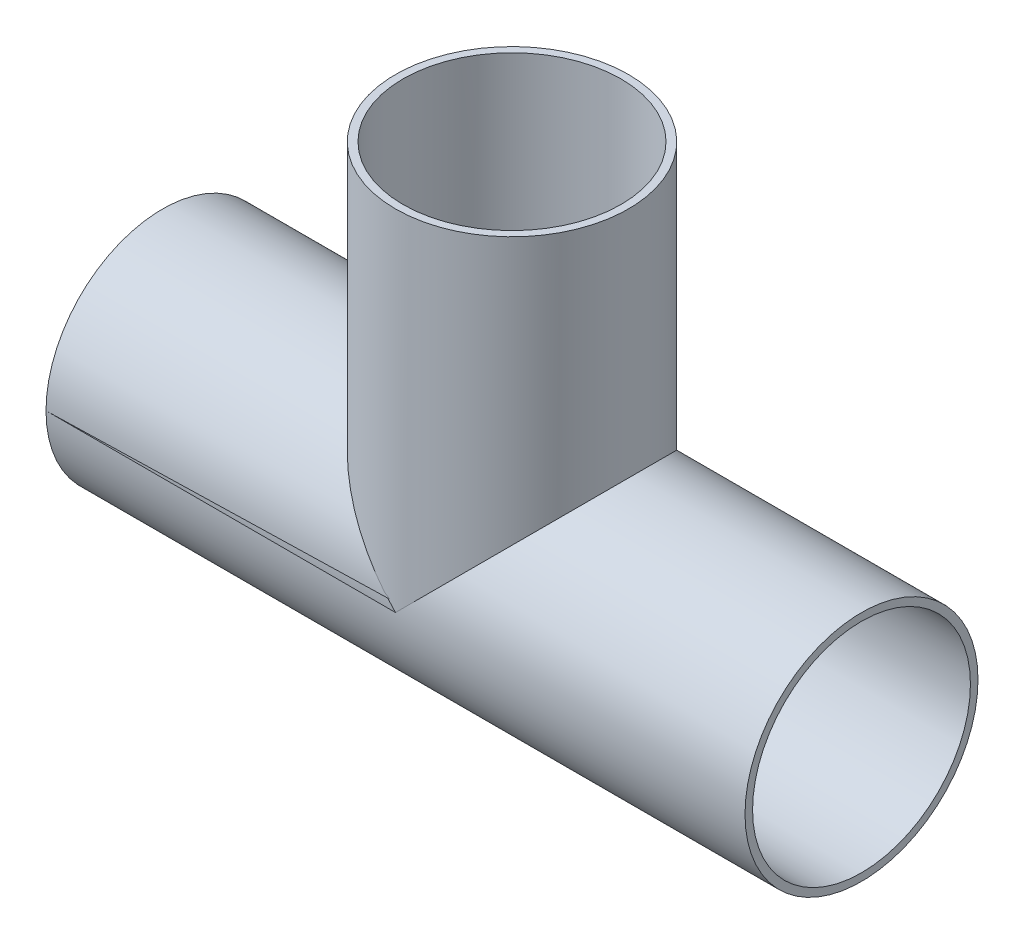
ISO-10303-21;
HEADER;
FILE_DESCRIPTION(('STEP AP214'),'2;1');
FILE_NAME('part.step','',(''),(''),'','','');
FILE_SCHEMA(('AUTOMOTIVE_DESIGN { 1 0 10303 214 1 1 1 1 }'));
ENDSEC;
DATA;
#1=APPLICATION_CONTEXT('core data for automotive mechanical design processes');
#2=APPLICATION_PROTOCOL_DEFINITION('international standard','automotive_design',2000,#1);
#3=PRODUCT_CONTEXT('',#1,'mechanical');
#4=PRODUCT('Part','Part','',(#3));
#5=PRODUCT_RELATED_PRODUCT_CATEGORY('part','',(#4));
#6=PRODUCT_DEFINITION_FORMATION('','',#4);
#7=PRODUCT_DEFINITION_CONTEXT('part definition',#1,'design');
#8=PRODUCT_DEFINITION('design','',#6,#7);
#9=PRODUCT_DEFINITION_SHAPE('','',#8);
#10=(LENGTH_UNIT() NAMED_UNIT(*) SI_UNIT(.MILLI.,.METRE.));
#11=(NAMED_UNIT(*) PLANE_ANGLE_UNIT() SI_UNIT($,.RADIAN.));
#12=(NAMED_UNIT(*) SI_UNIT($,.STERADIAN.) SOLID_ANGLE_UNIT());
#13=UNCERTAINTY_MEASURE_WITH_UNIT(LENGTH_MEASURE(1.E-05),#10,'distance_accuracy_value','');
#14=(GEOMETRIC_REPRESENTATION_CONTEXT(3) GLOBAL_UNCERTAINTY_ASSIGNED_CONTEXT((#13)) GLOBAL_UNIT_ASSIGNED_CONTEXT((#10,
#11,#12)) REPRESENTATION_CONTEXT('',''));
#15=CARTESIAN_POINT('',(0.,0.,0.));
#16=DIRECTION('',(0.,0.,1.));
#17=DIRECTION('',(1.,0.,0.));
#18=AXIS2_PLACEMENT_3D('',#15,#16,#17);
#19=CARTESIAN_POINT('',(0.,76.2,0.));
#20=DIRECTION('',(0.,-1.,0.));
#21=DIRECTION('',(0.,0.,-1.));
#22=AXIS2_PLACEMENT_3D('',#19,#20,#21);
#23=CYLINDRICAL_SURFACE('',#22,25.4);
#24=CARTESIAN_POINT('',(0.,76.2,0.));
#25=DIRECTION('',(0.,1.,0.));
#26=DIRECTION('',(0.,0.,1.));
#27=AXIS2_PLACEMENT_3D('',#24,#25,#26);
#28=CIRCLE('',#27,25.4);
#29=CARTESIAN_POINT('',(0.,76.2,25.4));
#30=VERTEX_POINT('',#29);
#31=EDGE_CURVE('E11',#30,#30,#28,.T.);
#32=ORIENTED_EDGE('',*,*,#31,.F.);
#33=EDGE_LOOP('',(#32));
#34=FACE_BOUND('',#33,.T.);
#35=CARTESIAN_POINT('',(0.,0.,0.));
#36=DIRECTION('',(-0.707106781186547,-0.707106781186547,0.));
#37=DIRECTION('',(0.707106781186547,-0.707106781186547,0.));
#38=AXIS2_PLACEMENT_3D('',#35,#36,#37);
#39=ELLIPSE('',#38,35.9210244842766,25.4);
#40=CARTESIAN_POINT('',(0.,0.,25.4));
#41=VERTEX_POINT('',#40);
#42=CARTESIAN_POINT('',(0.,0.,-25.4));
#43=VERTEX_POINT('',#42);
#44=EDGE_CURVE('E40',#41,#43,#39,.T.);
#45=ORIENTED_EDGE('',*,*,#44,.F.);
#46=CARTESIAN_POINT('',(0.,0.,0.));
#47=DIRECTION('',(0.707106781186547,-0.707106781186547,0.));
#48=DIRECTION('',(-0.707106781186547,-0.707106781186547,0.));
#49=AXIS2_PLACEMENT_3D('',#46,#47,#48);
#50=ELLIPSE('',#49,35.9210244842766,25.4);
#51=EDGE_CURVE('E53',#43,#41,#50,.T.);
#52=ORIENTED_EDGE('',*,*,#51,.F.);
#53=EDGE_LOOP('',(#45,#52));
#54=FACE_BOUND('',#53,.T.);
#55=ADVANCED_FACE('F33',(#34,#54),#23,.T.);
#56=CARTESIAN_POINT('',(0.,76.2,0.));
#57=DIRECTION('',(0.,1.,0.));
#58=DIRECTION('',(0.,0.,1.));
#59=AXIS2_PLACEMENT_3D('',#56,#57,#58);
#60=PLANE('',#59);
#61=CARTESIAN_POINT('',(0.,76.2,0.));
#62=DIRECTION('',(0.,1.,0.));
#63=DIRECTION('',(0.,0.,1.));
#64=AXIS2_PLACEMENT_3D('',#61,#62,#63);
#65=CIRCLE('',#64,23.749);
#66=CARTESIAN_POINT('',(0.,76.2,23.749));
#67=VERTEX_POINT('',#66);
#68=EDGE_CURVE('E65',#67,#67,#65,.T.);
#69=ORIENTED_EDGE('',*,*,#68,.F.);
#70=EDGE_LOOP('',(#69));
#71=FACE_BOUND('',#70,.T.);
#72=ORIENTED_EDGE('',*,*,#31,.T.);
#73=EDGE_LOOP('',(#72));
#74=FACE_BOUND('',#73,.T.);
#75=ADVANCED_FACE('F80',(#71,#74),#60,.T.);
#76=CARTESIAN_POINT('',(76.2,0.,0.));
#77=DIRECTION('',(-1.,0.,0.));
#78=DIRECTION('',(0.,0.,1.));
#79=AXIS2_PLACEMENT_3D('',#76,#77,#78);
#80=CYLINDRICAL_SURFACE('',#79,25.4);
#81=CARTESIAN_POINT('',(-76.2,0.,0.));
#82=DIRECTION('',(1.,0.,0.));
#83=DIRECTION('',(0.,0.,-1.));
#84=AXIS2_PLACEMENT_3D('',#81,#82,#83);
#85=CIRCLE('',#84,25.4);
#86=CARTESIAN_POINT('',(-76.2,0.,-25.4));
#87=VERTEX_POINT('',#86);
#88=EDGE_CURVE('E68',#87,#87,#85,.T.);
#89=ORIENTED_EDGE('',*,*,#88,.T.);
#90=EDGE_LOOP('',(#89));
#91=FACE_BOUND('',#90,.T.);
#92=CARTESIAN_POINT('',(76.2,0.,0.));
#93=DIRECTION('',(1.,0.,0.));
#94=DIRECTION('',(0.,0.,-1.));
#95=AXIS2_PLACEMENT_3D('',#92,#93,#94);
#96=CIRCLE('',#95,25.4);
#97=CARTESIAN_POINT('',(76.2,0.,-25.4));
#98=VERTEX_POINT('',#97);
#99=EDGE_CURVE('E72',#98,#98,#96,.T.);
#100=ORIENTED_EDGE('',*,*,#99,.F.);
#101=EDGE_LOOP('',(#100));
#102=FACE_BOUND('',#101,.T.);
#103=ORIENTED_EDGE('',*,*,#51,.T.);
#104=ORIENTED_EDGE('',*,*,#44,.T.);
#105=EDGE_LOOP('',(#103,#104));
#106=FACE_BOUND('',#105,.T.);
#107=ADVANCED_FACE('F78',(#91,#102,#106),#80,.T.);
#108=CARTESIAN_POINT('',(76.2,0.,0.));
#109=DIRECTION('',(1.,0.,0.));
#110=DIRECTION('',(0.,0.,-1.));
#111=AXIS2_PLACEMENT_3D('',#108,#109,#110);
#112=PLANE('',#111);
#113=CARTESIAN_POINT('',(76.2,0.,0.));
#114=DIRECTION('',(1.,0.,0.));
#115=DIRECTION('',(0.,0.,-1.));
#116=AXIS2_PLACEMENT_3D('',#113,#114,#115);
#117=CIRCLE('',#116,23.749);
#118=CARTESIAN_POINT('',(76.2,0.,-23.749));
#119=VERTEX_POINT('',#118);
#120=EDGE_CURVE('E112',#119,#119,#117,.T.);
#121=ORIENTED_EDGE('',*,*,#120,.F.);
#122=EDGE_LOOP('',(#121));
#123=FACE_BOUND('',#122,.T.);
#124=ORIENTED_EDGE('',*,*,#99,.T.);
#125=EDGE_LOOP('',(#124));
#126=FACE_BOUND('',#125,.T.);
#127=ADVANCED_FACE('F91',(#123,#126),#112,.T.);
#128=CARTESIAN_POINT('',(-76.2,0.,0.));
#129=DIRECTION('',(1.,0.,0.));
#130=DIRECTION('',(0.,0.,-1.));
#131=AXIS2_PLACEMENT_3D('',#128,#129,#130);
#132=PLANE('',#131);
#133=CARTESIAN_POINT('',(-76.2,0.,0.));
#134=DIRECTION('',(1.,0.,0.));
#135=DIRECTION('',(0.,0.,-1.));
#136=AXIS2_PLACEMENT_3D('',#133,#134,#135);
#137=CIRCLE('',#136,23.749);
#138=CARTESIAN_POINT('',(-76.2,0.,-23.749));
#139=VERTEX_POINT('',#138);
#140=EDGE_CURVE('E61',#139,#139,#137,.T.);
#141=ORIENTED_EDGE('',*,*,#140,.T.);
#142=EDGE_LOOP('',(#141));
#143=FACE_BOUND('',#142,.T.);
#144=ORIENTED_EDGE('',*,*,#88,.F.);
#145=EDGE_LOOP('',(#144));
#146=FACE_BOUND('',#145,.T.);
#147=ADVANCED_FACE('F96',(#143,#146),#132,.F.);
#148=CARTESIAN_POINT('',(0.,0.,0.));
#149=DIRECTION('',(0.,1.,0.));
#150=DIRECTION('',(0.,0.,1.));
#151=AXIS2_PLACEMENT_3D('',#148,#149,#150);
#152=CYLINDRICAL_SURFACE('',#151,23.749);
#153=CARTESIAN_POINT('',(0.,0.,0.));
#154=DIRECTION('',(-0.707106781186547,0.707106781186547,0.));
#155=DIRECTION('',(0.707106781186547,0.707106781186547,0.));
#156=AXIS2_PLACEMENT_3D('',#153,#154,#155);
#157=ELLIPSE('',#156,33.5861578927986,23.749);
#158=CARTESIAN_POINT('',(0.,0.,-23.749));
#159=VERTEX_POINT('',#158);
#160=CARTESIAN_POINT('',(0.,0.,23.749));
#161=VERTEX_POINT('',#160);
#162=EDGE_CURVE('E58',#159,#161,#157,.F.);
#163=ORIENTED_EDGE('',*,*,#162,.T.);
#164=CARTESIAN_POINT('',(0.,0.,0.));
#165=DIRECTION('',(0.707106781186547,0.707106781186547,0.));
#166=DIRECTION('',(-0.707106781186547,0.707106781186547,0.));
#167=AXIS2_PLACEMENT_3D('',#164,#165,#166);
#168=ELLIPSE('',#167,33.5861578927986,23.749);
#169=EDGE_CURVE('E46',#161,#159,#168,.F.);
#170=ORIENTED_EDGE('',*,*,#169,.T.);
#171=EDGE_LOOP('',(#163,#170));
#172=FACE_BOUND('',#171,.T.);
#173=ORIENTED_EDGE('',*,*,#68,.T.);
#174=EDGE_LOOP('',(#173));
#175=FACE_BOUND('',#174,.T.);
#176=ADVANCED_FACE('F63',(#172,#175),#152,.F.);
#177=CARTESIAN_POINT('',(-76.2,0.,0.));
#178=DIRECTION('',(1.,0.,0.));
#179=DIRECTION('',(0.,0.,-1.));
#180=AXIS2_PLACEMENT_3D('',#177,#178,#179);
#181=CYLINDRICAL_SURFACE('',#180,23.749);
#182=ORIENTED_EDGE('',*,*,#120,.T.);
#183=EDGE_LOOP('',(#182));
#184=FACE_BOUND('',#183,.T.);
#185=ORIENTED_EDGE('',*,*,#140,.F.);
#186=EDGE_LOOP('',(#185));
#187=FACE_BOUND('',#186,.T.);
#188=ORIENTED_EDGE('',*,*,#162,.F.);
#189=ORIENTED_EDGE('',*,*,#169,.F.);
#190=EDGE_LOOP('',(#188,#189));
#191=FACE_BOUND('',#190,.T.);
#192=ADVANCED_FACE('F59',(#184,#187,#191),#181,.F.);
#193=CLOSED_SHELL('',(#55,#75,#107,#127,#147,#176,#192));
#194=MANIFOLD_SOLID_BREP('B2',#193);
#195=ADVANCED_BREP_SHAPE_REPRESENTATION('',(#18,#194),#14);
#196=SHAPE_DEFINITION_REPRESENTATION(#9,#195);
ENDSEC;
END-ISO-10303-21;
